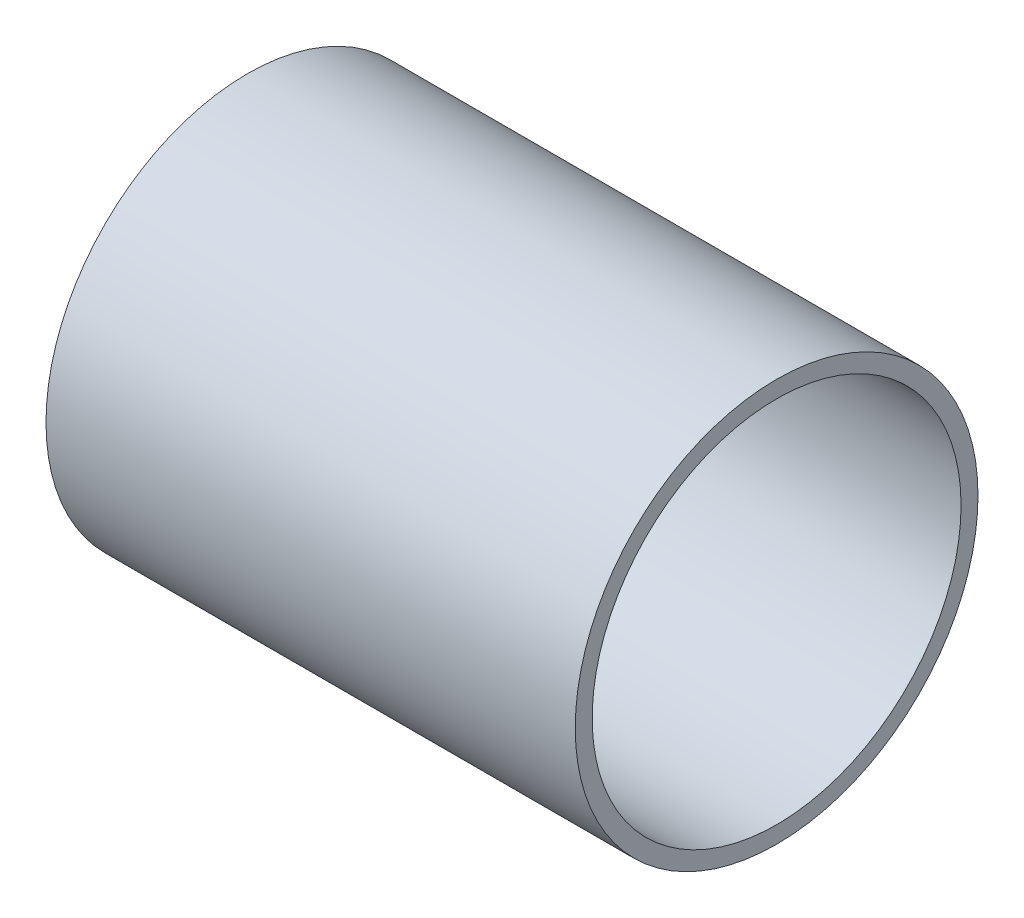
ISO-10303-21;
HEADER;
FILE_DESCRIPTION(('STEP AP214'),'2;1');
FILE_NAME('part.step','',(''),(''),'','','');
FILE_SCHEMA(('AUTOMOTIVE_DESIGN { 1 0 10303 214 1 1 1 1 }'));
ENDSEC;
DATA;
#1=APPLICATION_CONTEXT('core data for automotive mechanical design processes');
#2=APPLICATION_PROTOCOL_DEFINITION('international standard','automotive_design',2000,#1);
#3=PRODUCT_CONTEXT('',#1,'mechanical');
#4=PRODUCT('Part','Part','',(#3));
#5=PRODUCT_RELATED_PRODUCT_CATEGORY('part','',(#4));
#6=PRODUCT_DEFINITION_FORMATION('','',#4);
#7=PRODUCT_DEFINITION_CONTEXT('part definition',#1,'design');
#8=PRODUCT_DEFINITION('design','',#6,#7);
#9=PRODUCT_DEFINITION_SHAPE('','',#8);
#10=(LENGTH_UNIT() NAMED_UNIT(*) SI_UNIT(.MILLI.,.METRE.));
#11=(NAMED_UNIT(*) PLANE_ANGLE_UNIT() SI_UNIT($,.RADIAN.));
#12=(NAMED_UNIT(*) SI_UNIT($,.STERADIAN.) SOLID_ANGLE_UNIT());
#13=UNCERTAINTY_MEASURE_WITH_UNIT(LENGTH_MEASURE(1.E-05),#10,'distance_accuracy_value','');
#14=(GEOMETRIC_REPRESENTATION_CONTEXT(3) GLOBAL_UNCERTAINTY_ASSIGNED_CONTEXT((#13)) GLOBAL_UNIT_ASSIGNED_CONTEXT((#10,
#11,#12)) REPRESENTATION_CONTEXT('',''));
#15=CARTESIAN_POINT('',(0.,0.,0.));
#16=DIRECTION('',(0.,0.,1.));
#17=DIRECTION('',(1.,0.,0.));
#18=AXIS2_PLACEMENT_3D('',#15,#16,#17);
#19=CARTESIAN_POINT('',(100.,0.,0.));
#20=DIRECTION('',(-1.,0.,0.));
#21=DIRECTION('',(0.,0.,1.));
#22=AXIS2_PLACEMENT_3D('',#19,#20,#21);
#23=CYLINDRICAL_SURFACE('',#22,34.85);
#24=CARTESIAN_POINT('',(100.,0.,0.));
#25=DIRECTION('',(1.,0.,0.));
#26=DIRECTION('',(0.,0.,-1.));
#27=AXIS2_PLACEMENT_3D('',#24,#25,#26);
#28=CIRCLE('',#27,34.85);
#29=CARTESIAN_POINT('',(100.,0.,-34.85));
#30=VERTEX_POINT('',#29);
#31=EDGE_CURVE('E45',#30,#30,#28,.T.);
#32=ORIENTED_EDGE('',*,*,#31,.T.);
#33=EDGE_LOOP('',(#32));
#34=FACE_BOUND('',#33,.T.);
#35=CARTESIAN_POINT('',(0.,0.,0.));
#36=DIRECTION('',(1.,0.,0.));
#37=DIRECTION('',(0.,0.,-1.));
#38=AXIS2_PLACEMENT_3D('',#35,#36,#37);
#39=CIRCLE('',#38,34.85);
#40=CARTESIAN_POINT('',(0.,0.,-34.85));
#41=VERTEX_POINT('',#40);
#42=EDGE_CURVE('E51',#41,#41,#39,.T.);
#43=ORIENTED_EDGE('',*,*,#42,.F.);
#44=EDGE_LOOP('',(#43));
#45=FACE_BOUND('',#44,.T.);
#46=ADVANCED_FACE('F38',(#34,#45),#23,.F.);
#47=CARTESIAN_POINT('',(100.,0.,0.));
#48=DIRECTION('',(-1.,0.,0.));
#49=DIRECTION('',(0.,0.,1.));
#50=AXIS2_PLACEMENT_3D('',#47,#48,#49);
#51=CYLINDRICAL_SURFACE('',#50,38.05);
#52=CARTESIAN_POINT('',(100.,0.,0.));
#53=DIRECTION('',(1.,0.,0.));
#54=DIRECTION('',(0.,0.,-1.));
#55=AXIS2_PLACEMENT_3D('',#52,#53,#54);
#56=CIRCLE('',#55,38.05);
#57=CARTESIAN_POINT('',(100.,0.,-38.05));
#58=VERTEX_POINT('',#57);
#59=EDGE_CURVE('E10',#58,#58,#56,.T.);
#60=ORIENTED_EDGE('',*,*,#59,.F.);
#61=EDGE_LOOP('',(#60));
#62=FACE_BOUND('',#61,.T.);
#63=CARTESIAN_POINT('',(0.,0.,0.));
#64=DIRECTION('',(1.,0.,0.));
#65=DIRECTION('',(0.,0.,-1.));
#66=AXIS2_PLACEMENT_3D('',#63,#64,#65);
#67=CIRCLE('',#66,38.05);
#68=CARTESIAN_POINT('',(0.,0.,-38.05));
#69=VERTEX_POINT('',#68);
#70=EDGE_CURVE('E41',#69,#69,#67,.T.);
#71=ORIENTED_EDGE('',*,*,#70,.T.);
#72=EDGE_LOOP('',(#71));
#73=FACE_BOUND('',#72,.T.);
#74=ADVANCED_FACE('F58',(#62,#73),#51,.T.);
#75=CARTESIAN_POINT('',(100.,0.,0.));
#76=DIRECTION('',(1.,0.,0.));
#77=DIRECTION('',(0.,0.,-1.));
#78=AXIS2_PLACEMENT_3D('',#75,#76,#77);
#79=PLANE('',#78);
#80=ORIENTED_EDGE('',*,*,#31,.F.);
#81=EDGE_LOOP('',(#80));
#82=FACE_BOUND('',#81,.T.);
#83=ORIENTED_EDGE('',*,*,#59,.T.);
#84=EDGE_LOOP('',(#83));
#85=FACE_BOUND('',#84,.T.);
#86=ADVANCED_FACE('F62',(#82,#85),#79,.T.);
#87=CARTESIAN_POINT('',(0.,0.,0.));
#88=DIRECTION('',(1.,0.,0.));
#89=DIRECTION('',(0.,0.,-1.));
#90=AXIS2_PLACEMENT_3D('',#87,#88,#89);
#91=PLANE('',#90);
#92=ORIENTED_EDGE('',*,*,#42,.T.);
#93=EDGE_LOOP('',(#92));
#94=FACE_BOUND('',#93,.T.);
#95=ORIENTED_EDGE('',*,*,#70,.F.);
#96=EDGE_LOOP('',(#95));
#97=FACE_BOUND('',#96,.T.);
#98=ADVANCED_FACE('F60',(#94,#97),#91,.F.);
#99=CLOSED_SHELL('',(#46,#74,#86,#98));
#100=MANIFOLD_SOLID_BREP('B2',#99);
#101=ADVANCED_BREP_SHAPE_REPRESENTATION('',(#18,#100),#14);
#102=SHAPE_DEFINITION_REPRESENTATION(#9,#101);
ENDSEC;
END-ISO-10303-21;
